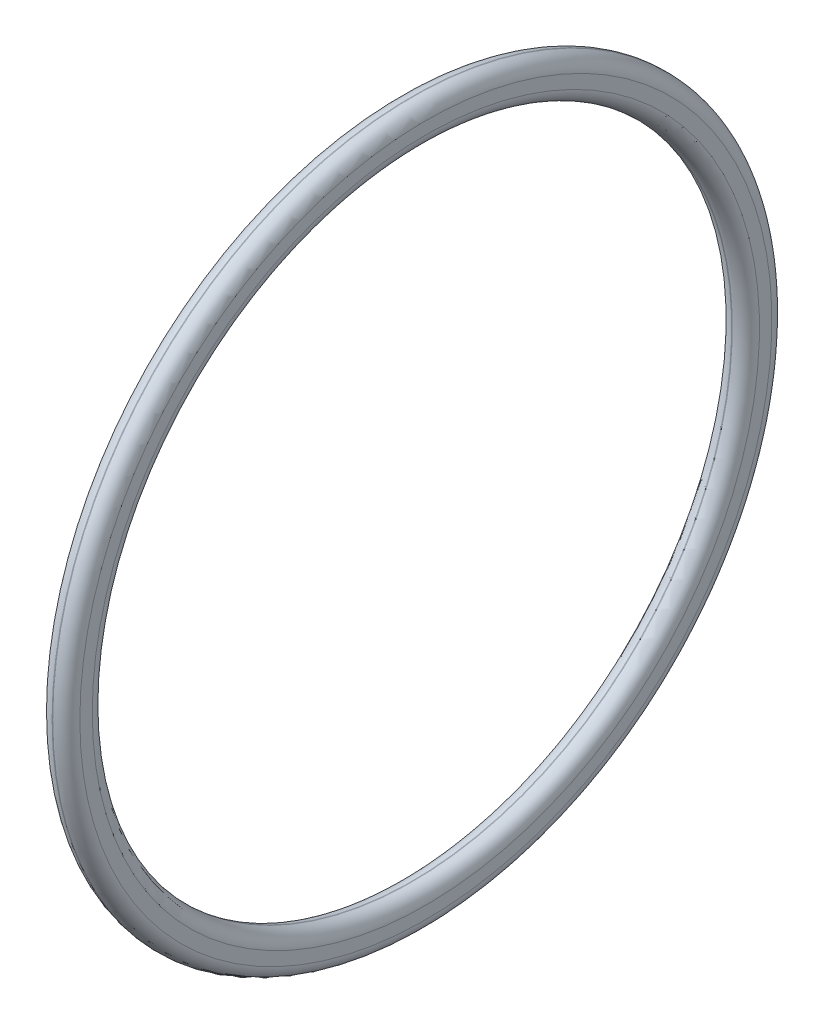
ISO-10303-21;
HEADER;
FILE_DESCRIPTION(('STEP AP214'),'2;1');
FILE_NAME('part.step','',(''),(''),'','','');
FILE_SCHEMA(('AUTOMOTIVE_DESIGN { 1 0 10303 214 1 1 1 1 }'));
ENDSEC;
DATA;
#1=APPLICATION_CONTEXT('core data for automotive mechanical design processes');
#2=APPLICATION_PROTOCOL_DEFINITION('international standard','automotive_design',2000,#1);
#3=PRODUCT_CONTEXT('',#1,'mechanical');
#4=PRODUCT('Part','Part','',(#3));
#5=PRODUCT_RELATED_PRODUCT_CATEGORY('part','',(#4));
#6=PRODUCT_DEFINITION_FORMATION('','',#4);
#7=PRODUCT_DEFINITION_CONTEXT('part definition',#1,'design');
#8=PRODUCT_DEFINITION('design','',#6,#7);
#9=PRODUCT_DEFINITION_SHAPE('','',#8);
#10=(LENGTH_UNIT() NAMED_UNIT(*) SI_UNIT(.MILLI.,.METRE.));
#11=(NAMED_UNIT(*) PLANE_ANGLE_UNIT() SI_UNIT($,.RADIAN.));
#12=(NAMED_UNIT(*) SI_UNIT($,.STERADIAN.) SOLID_ANGLE_UNIT());
#13=UNCERTAINTY_MEASURE_WITH_UNIT(LENGTH_MEASURE(1.E-05),#10,'distance_accuracy_value','');
#14=(GEOMETRIC_REPRESENTATION_CONTEXT(3) GLOBAL_UNCERTAINTY_ASSIGNED_CONTEXT((#13)) GLOBAL_UNIT_ASSIGNED_CONTEXT((#10,
#11,#12)) REPRESENTATION_CONTEXT('',''));
#15=CARTESIAN_POINT('',(0.,0.,0.));
#16=DIRECTION('',(0.,0.,1.));
#17=DIRECTION('',(1.,0.,0.));
#18=AXIS2_PLACEMENT_3D('',#15,#16,#17);
#19=CARTESIAN_POINT('',(0.0249999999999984,0.,0.));
#20=DIRECTION('',(-1.,0.,0.));
#21=DIRECTION('',(0.,0.,1.));
#22=AXIS2_PLACEMENT_3D('',#19,#20,#21);
#23=TOROIDAL_SURFACE('',#22,27.4464144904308,1.07509928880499);
#24=CARTESIAN_POINT('',(0.0249999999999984,0.,0.));
#25=DIRECTION('',(-1.,0.,0.));
#26=DIRECTION('',(0.,0.,1.));
#27=AXIS2_PLACEMENT_3D('',#24,#25,#26);
#28=CIRCLE('',#27,28.5215137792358);
#29=CARTESIAN_POINT('',(0.0249999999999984,0.,28.5215137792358));
#30=VERTEX_POINT('',#29);
#31=EDGE_CURVE('E10',#30,#30,#28,.T.);
#32=ORIENTED_EDGE('',*,*,#31,.F.);
#33=EDGE_LOOP('',(#32));
#34=FACE_BOUND('',#33,.T.);
#35=CARTESIAN_POINT('',(1.10009928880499,0.,0.));
#36=DIRECTION('',(-1.,0.,0.));
#37=DIRECTION('',(0.,0.,1.));
#38=AXIS2_PLACEMENT_3D('',#35,#36,#37);
#39=CIRCLE('',#38,27.4464144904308);
#40=CARTESIAN_POINT('',(1.10009928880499,0.,27.4464144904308));
#41=VERTEX_POINT('',#40);
#42=EDGE_CURVE('E58',#41,#41,#39,.T.);
#43=ORIENTED_EDGE('',*,*,#42,.T.);
#44=EDGE_LOOP('',(#43));
#45=FACE_BOUND('',#44,.T.);
#46=ADVANCED_FACE('F30',(#34,#45),#23,.T.);
#47=CARTESIAN_POINT('',(0.,0.,0.));
#48=DIRECTION('',(-1.,0.,0.));
#49=DIRECTION('',(0.,0.,1.));
#50=AXIS2_PLACEMENT_3D('',#47,#48,#49);
#51=CYLINDRICAL_SURFACE('',#50,28.5215137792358);
#52=CARTESIAN_POINT('',(-0.0249999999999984,0.,0.));
#53=DIRECTION('',(-1.,0.,0.));
#54=DIRECTION('',(0.,0.,1.));
#55=AXIS2_PLACEMENT_3D('',#52,#53,#54);
#56=CIRCLE('',#55,28.5215137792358);
#57=CARTESIAN_POINT('',(-0.0249999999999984,0.,28.5215137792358));
#58=VERTEX_POINT('',#57);
#59=EDGE_CURVE('E36',#58,#58,#56,.T.);
#60=ORIENTED_EDGE('',*,*,#59,.F.);
#61=EDGE_LOOP('',(#60));
#62=FACE_BOUND('',#61,.T.);
#63=ORIENTED_EDGE('',*,*,#31,.T.);
#64=EDGE_LOOP('',(#63));
#65=FACE_BOUND('',#64,.T.);
#66=ADVANCED_FACE('F95',(#62,#65),#51,.T.);
#67=CARTESIAN_POINT('',(-0.0250000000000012,0.,0.));
#68=DIRECTION('',(-1.,0.,0.));
#69=DIRECTION('',(0.,0.,1.));
#70=AXIS2_PLACEMENT_3D('',#67,#68,#69);
#71=TOROIDAL_SURFACE('',#70,27.4464144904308,1.07509928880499);
#72=CARTESIAN_POINT('',(-1.10009928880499,0.,0.));
#73=DIRECTION('',(-1.,0.,0.));
#74=DIRECTION('',(0.,0.,1.));
#75=AXIS2_PLACEMENT_3D('',#72,#73,#74);
#76=CIRCLE('',#75,27.4464144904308);
#77=CARTESIAN_POINT('',(-1.10009928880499,0.,27.4464144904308));
#78=VERTEX_POINT('',#77);
#79=EDGE_CURVE('E40',#78,#78,#76,.T.);
#80=ORIENTED_EDGE('',*,*,#79,.F.);
#81=EDGE_LOOP('',(#80));
#82=FACE_BOUND('',#81,.T.);
#83=ORIENTED_EDGE('',*,*,#59,.T.);
#84=EDGE_LOOP('',(#83));
#85=FACE_BOUND('',#84,.T.);
#86=ADVANCED_FACE('F90',(#82,#85),#71,.T.);
#87=CARTESIAN_POINT('',(-1.10009928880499,27.4464144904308,0.));
#88=DIRECTION('',(1.,0.,0.));
#89=DIRECTION('',(0.,0.,-1.));
#90=AXIS2_PLACEMENT_3D('',#87,#88,#89);
#91=PLANE('',#90);
#92=CARTESIAN_POINT('',(-1.10009928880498,0.,0.));
#93=DIRECTION('',(-1.,0.,0.));
#94=DIRECTION('',(0.,0.,1.));
#95=AXIS2_PLACEMENT_3D('',#92,#93,#94);
#96=CIRCLE('',#95,26.4597739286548);
#97=CARTESIAN_POINT('',(-1.10009928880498,0.,26.4597739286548));
#98=VERTEX_POINT('',#97);
#99=EDGE_CURVE('E44',#98,#98,#96,.T.);
#100=ORIENTED_EDGE('',*,*,#99,.F.);
#101=EDGE_LOOP('',(#100));
#102=FACE_BOUND('',#101,.T.);
#103=ORIENTED_EDGE('',*,*,#79,.T.);
#104=EDGE_LOOP('',(#103));
#105=FACE_BOUND('',#104,.T.);
#106=ADVANCED_FACE('F84',(#102,#105),#91,.F.);
#107=CARTESIAN_POINT('',(-0.0250000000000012,0.,0.));
#108=DIRECTION('',(-1.,0.,0.));
#109=DIRECTION('',(0.,0.,1.));
#110=AXIS2_PLACEMENT_3D('',#107,#108,#109);
#111=TOROIDAL_SURFACE('',#110,26.4597739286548,1.07509928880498);
#112=CARTESIAN_POINT('',(-0.0249999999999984,0.,0.));
#113=DIRECTION('',(-1.,0.,0.));
#114=DIRECTION('',(0.,0.,1.));
#115=AXIS2_PLACEMENT_3D('',#112,#113,#114);
#116=CIRCLE('',#115,25.3846746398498);
#117=CARTESIAN_POINT('',(-0.0249999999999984,0.,25.3846746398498));
#118=VERTEX_POINT('',#117);
#119=EDGE_CURVE('E49',#118,#118,#116,.T.);
#120=ORIENTED_EDGE('',*,*,#119,.F.);
#121=EDGE_LOOP('',(#120));
#122=FACE_BOUND('',#121,.T.);
#123=ORIENTED_EDGE('',*,*,#99,.T.);
#124=EDGE_LOOP('',(#123));
#125=FACE_BOUND('',#124,.T.);
#126=ADVANCED_FACE('F78',(#122,#125),#111,.T.);
#127=CARTESIAN_POINT('',(0.,0.,0.));
#128=DIRECTION('',(-1.,0.,0.));
#129=DIRECTION('',(0.,0.,1.));
#130=AXIS2_PLACEMENT_3D('',#127,#128,#129);
#131=CYLINDRICAL_SURFACE('',#130,25.3846746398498);
#132=CARTESIAN_POINT('',(0.0249999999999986,0.,0.));
#133=DIRECTION('',(-1.,0.,0.));
#134=DIRECTION('',(0.,0.,1.));
#135=AXIS2_PLACEMENT_3D('',#132,#133,#134);
#136=CIRCLE('',#135,25.3846746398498);
#137=CARTESIAN_POINT('',(0.0249999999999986,0.,25.3846746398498));
#138=VERTEX_POINT('',#137);
#139=EDGE_CURVE('E52',#138,#138,#136,.T.);
#140=ORIENTED_EDGE('',*,*,#139,.F.);
#141=EDGE_LOOP('',(#140));
#142=FACE_BOUND('',#141,.T.);
#143=ORIENTED_EDGE('',*,*,#119,.T.);
#144=EDGE_LOOP('',(#143));
#145=FACE_BOUND('',#144,.T.);
#146=ADVANCED_FACE('F72',(#142,#145),#131,.F.);
#147=CARTESIAN_POINT('',(0.0249999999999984,0.,0.));
#148=DIRECTION('',(-1.,0.,0.));
#149=DIRECTION('',(0.,0.,1.));
#150=AXIS2_PLACEMENT_3D('',#147,#148,#149);
#151=TOROIDAL_SURFACE('',#150,26.4597739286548,1.07509928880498);
#152=CARTESIAN_POINT('',(1.10009928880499,0.,0.));
#153=DIRECTION('',(-1.,0.,0.));
#154=DIRECTION('',(0.,0.,1.));
#155=AXIS2_PLACEMENT_3D('',#152,#153,#154);
#156=CIRCLE('',#155,26.4597739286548);
#157=CARTESIAN_POINT('',(1.10009928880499,0.,26.4597739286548));
#158=VERTEX_POINT('',#157);
#159=EDGE_CURVE('E55',#158,#158,#156,.T.);
#160=ORIENTED_EDGE('',*,*,#159,.F.);
#161=EDGE_LOOP('',(#160));
#162=FACE_BOUND('',#161,.T.);
#163=ORIENTED_EDGE('',*,*,#139,.T.);
#164=EDGE_LOOP('',(#163));
#165=FACE_BOUND('',#164,.T.);
#166=ADVANCED_FACE('F66',(#162,#165),#151,.T.);
#167=CARTESIAN_POINT('',(1.10009928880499,27.4464144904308,0.));
#168=DIRECTION('',(-1.,0.,0.));
#169=DIRECTION('',(0.,0.,1.));
#170=AXIS2_PLACEMENT_3D('',#167,#168,#169);
#171=PLANE('',#170);
#172=ORIENTED_EDGE('',*,*,#42,.F.);
#173=EDGE_LOOP('',(#172));
#174=FACE_BOUND('',#173,.T.);
#175=ORIENTED_EDGE('',*,*,#159,.T.);
#176=EDGE_LOOP('',(#175));
#177=FACE_BOUND('',#176,.T.);
#178=ADVANCED_FACE('F63',(#174,#177),#171,.F.);
#179=CLOSED_SHELL('',(#46,#66,#86,#106,#126,#146,#166,#178));
#180=MANIFOLD_SOLID_BREP('B2',#179);
#181=ADVANCED_BREP_SHAPE_REPRESENTATION('',(#18,#180),#14);
#182=SHAPE_DEFINITION_REPRESENTATION(#9,#181);
ENDSEC;
END-ISO-10303-21;
